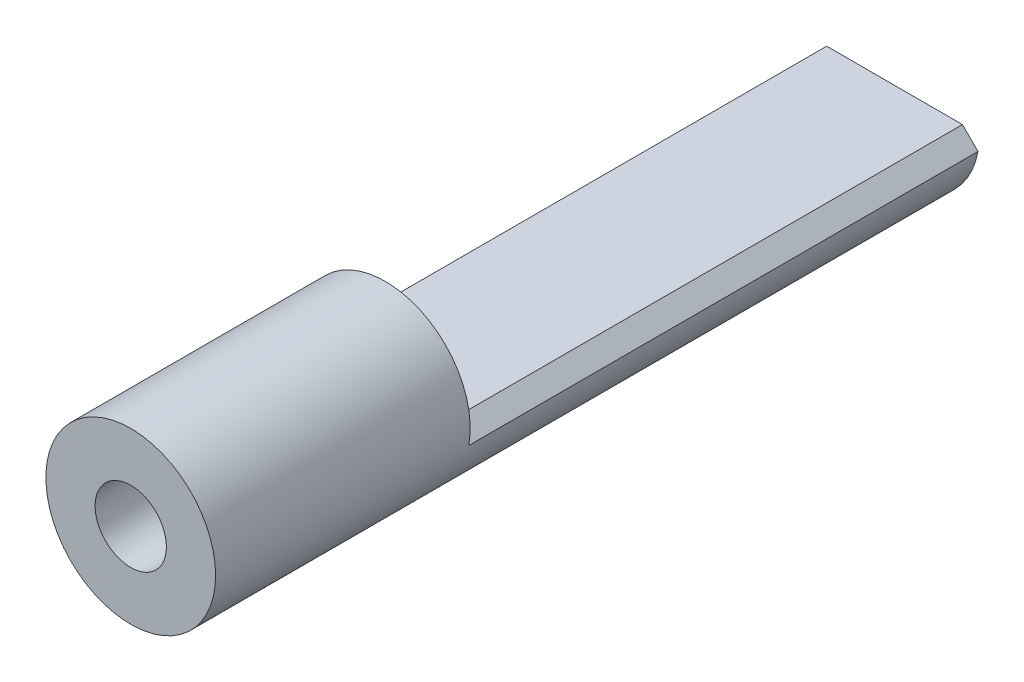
ISO-10303-21;
HEADER;
FILE_DESCRIPTION(('STEP AP214'),'2;1');
FILE_NAME('part.step','',(''),(''),'','','');
FILE_SCHEMA(('AUTOMOTIVE_DESIGN { 1 0 10303 214 1 1 1 1 }'));
ENDSEC;
DATA;
#1=APPLICATION_CONTEXT('core data for automotive mechanical design processes');
#2=APPLICATION_PROTOCOL_DEFINITION('international standard','automotive_design',2000,#1);
#3=PRODUCT_CONTEXT('',#1,'mechanical');
#4=PRODUCT('Part','Part','',(#3));
#5=PRODUCT_RELATED_PRODUCT_CATEGORY('part','',(#4));
#6=PRODUCT_DEFINITION_FORMATION('','',#4);
#7=PRODUCT_DEFINITION_CONTEXT('part definition',#1,'design');
#8=PRODUCT_DEFINITION('design','',#6,#7);
#9=PRODUCT_DEFINITION_SHAPE('','',#8);
#10=(LENGTH_UNIT() NAMED_UNIT(*) SI_UNIT(.MILLI.,.METRE.));
#11=(NAMED_UNIT(*) PLANE_ANGLE_UNIT() SI_UNIT($,.RADIAN.));
#12=(NAMED_UNIT(*) SI_UNIT($,.STERADIAN.) SOLID_ANGLE_UNIT());
#13=UNCERTAINTY_MEASURE_WITH_UNIT(LENGTH_MEASURE(1.E-05),#10,'distance_accuracy_value','');
#14=(GEOMETRIC_REPRESENTATION_CONTEXT(3) GLOBAL_UNCERTAINTY_ASSIGNED_CONTEXT((#13)) GLOBAL_UNIT_ASSIGNED_CONTEXT((#10,
#11,#12)) REPRESENTATION_CONTEXT('',''));
#15=CARTESIAN_POINT('',(0.,0.,0.));
#16=DIRECTION('',(0.,0.,1.));
#17=DIRECTION('',(1.,0.,0.));
#18=AXIS2_PLACEMENT_3D('',#15,#16,#17);
#19=CARTESIAN_POINT('',(0.,0.,45.));
#20=DIRECTION('',(0.,0.,-1.));
#21=DIRECTION('',(-1.,0.,0.));
#22=AXIS2_PLACEMENT_3D('',#19,#20,#21);
#23=CYLINDRICAL_SURFACE('',#22,5.);
#24=CARTESIAN_POINT('',(0.,0.,45.));
#25=DIRECTION('',(0.,0.,1.));
#26=DIRECTION('',(1.,0.,0.));
#27=AXIS2_PLACEMENT_3D('',#24,#25,#26);
#28=CIRCLE('',#27,5.);
#29=CARTESIAN_POINT('',(5.,0.,45.));
#30=VERTEX_POINT('',#29);
#31=EDGE_CURVE('E141',#30,#30,#28,.T.);
#32=ORIENTED_EDGE('',*,*,#31,.F.);
#33=EDGE_LOOP('',(#32));
#34=FACE_BOUND('',#33,.T.);
#35=CARTESIAN_POINT('',(0.,0.,30.));
#36=DIRECTION('',(0.,0.,1.));
#37=DIRECTION('',(1.,0.,0.));
#38=AXIS2_PLACEMENT_3D('',#35,#36,#37);
#39=CIRCLE('',#38,5.);
#40=CARTESIAN_POINT('',(-4.91547594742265,-0.91547594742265,30.));
#41=VERTEX_POINT('',#40);
#42=CARTESIAN_POINT('',(4.91547594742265,-0.915475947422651,30.));
#43=VERTEX_POINT('',#42);
#44=EDGE_CURVE('E137',#41,#43,#39,.F.);
#45=ORIENTED_EDGE('',*,*,#44,.F.);
#46=DIRECTION('',(0.,0.,-1.));
#47=VECTOR('',#46,1.);
#48=CARTESIAN_POINT('',(-4.91547594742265,-0.915475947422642,45.));
#49=LINE('',#48,#47);
#50=CARTESIAN_POINT('',(-4.91547594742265,-0.915475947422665,0.));
#51=VERTEX_POINT('',#50);
#52=EDGE_CURVE('E152',#41,#51,#49,.T.);
#53=ORIENTED_EDGE('',*,*,#52,.T.);
#54=CARTESIAN_POINT('',(0.,0.,0.));
#55=DIRECTION('',(0.,0.,1.));
#56=DIRECTION('',(1.,0.,0.));
#57=AXIS2_PLACEMENT_3D('',#54,#55,#56);
#58=CIRCLE('',#57,5.);
#59=CARTESIAN_POINT('',(4.91547594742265,-0.915475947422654,0.));
#60=VERTEX_POINT('',#59);
#61=EDGE_CURVE('E140',#51,#60,#58,.T.);
#62=ORIENTED_EDGE('',*,*,#61,.T.);
#63=DIRECTION('',(0.,0.,-1.));
#64=VECTOR('',#63,1.);
#65=CARTESIAN_POINT('',(4.91547594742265,-0.915475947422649,45.));
#66=LINE('',#65,#64);
#67=EDGE_CURVE('E145',#60,#43,#66,.F.);
#68=ORIENTED_EDGE('',*,*,#67,.T.);
#69=EDGE_LOOP('',(#45,#53,#62,#68));
#70=FACE_BOUND('',#69,.T.);
#71=ADVANCED_FACE('F49',(#34,#70),#23,.T.);
#72=CARTESIAN_POINT('',(0.,0.,45.));
#73=DIRECTION('',(0.,0.,1.));
#74=DIRECTION('',(1.,0.,0.));
#75=AXIS2_PLACEMENT_3D('',#72,#73,#74);
#76=PLANE('',#75);
#77=CARTESIAN_POINT('',(0.,0.,45.));
#78=DIRECTION('',(0.,0.,1.));
#79=DIRECTION('',(1.,0.,0.));
#80=AXIS2_PLACEMENT_3D('',#77,#78,#79);
#81=CIRCLE('',#80,2.1);
#82=CARTESIAN_POINT('',(2.1,0.,45.));
#83=VERTEX_POINT('',#82);
#84=EDGE_CURVE('E123',#83,#83,#81,.T.);
#85=ORIENTED_EDGE('',*,*,#84,.F.);
#86=EDGE_LOOP('',(#85));
#87=FACE_BOUND('',#86,.T.);
#88=ORIENTED_EDGE('',*,*,#31,.T.);
#89=EDGE_LOOP('',(#88));
#90=FACE_BOUND('',#89,.T.);
#91=ADVANCED_FACE('F195',(#87,#90),#76,.T.);
#92=CARTESIAN_POINT('',(0.,0.,0.));
#93=DIRECTION('',(0.,0.,1.));
#94=DIRECTION('',(1.,0.,0.));
#95=AXIS2_PLACEMENT_3D('',#92,#93,#94);
#96=PLANE('',#95);
#97=CARTESIAN_POINT('',(2.47487373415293,-2.4748737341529,0.));
#98=DIRECTION('',(0.,0.,-1.));
#99=DIRECTION('',(-1.,0.,0.));
#100=AXIS2_PLACEMENT_3D('',#97,#98,#99);
#101=CIRCLE('',#100,0.799999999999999);
#102=CARTESIAN_POINT('',(1.67487373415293,-2.4748737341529,0.));
#103=VERTEX_POINT('',#102);
#104=EDGE_CURVE('E110',#103,#103,#101,.T.);
#105=ORIENTED_EDGE('',*,*,#104,.F.);
#106=EDGE_LOOP('',(#105));
#107=FACE_BOUND('',#106,.T.);
#108=CARTESIAN_POINT('',(-2.4748737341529,-2.47487373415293,0.));
#109=DIRECTION('',(0.,0.,-1.));
#110=DIRECTION('',(-1.,0.,0.));
#111=AXIS2_PLACEMENT_3D('',#108,#109,#110);
#112=CIRCLE('',#111,0.799999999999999);
#113=CARTESIAN_POINT('',(-3.2748737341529,-2.47487373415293,0.));
#114=VERTEX_POINT('',#113);
#115=EDGE_CURVE('E109',#114,#114,#112,.T.);
#116=ORIENTED_EDGE('',*,*,#115,.F.);
#117=EDGE_LOOP('',(#116));
#118=FACE_BOUND('',#117,.T.);
#119=ORIENTED_EDGE('',*,*,#61,.F.);
#120=DIRECTION('',(-0.707106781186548,-0.707106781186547,0.));
#121=VECTOR('',#120,1.);
#122=CARTESIAN_POINT('',(-4.91547594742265,-0.915475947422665,0.));
#123=LINE('',#122,#121);
#124=CARTESIAN_POINT('',(-3.99999999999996,0.,0.));
#125=VERTEX_POINT('',#124);
#126=EDGE_CURVE('E159',#51,#125,#123,.F.);
#127=ORIENTED_EDGE('',*,*,#126,.T.);
#128=DIRECTION('',(-1.,0.,0.));
#129=VECTOR('',#128,1.);
#130=CARTESIAN_POINT('',(5.,0.,0.));
#131=LINE('',#130,#129);
#132=CARTESIAN_POINT('',(4.,0.,0.));
#133=VERTEX_POINT('',#132);
#134=EDGE_CURVE('E131',#133,#125,#131,.T.);
#135=ORIENTED_EDGE('',*,*,#134,.F.);
#136=DIRECTION('',(-0.707106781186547,0.707106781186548,0.));
#137=VECTOR('',#136,1.);
#138=CARTESIAN_POINT('',(4.,0.,0.));
#139=LINE('',#138,#137);
#140=EDGE_CURVE('E156',#133,#60,#139,.F.);
#141=ORIENTED_EDGE('',*,*,#140,.T.);
#142=EDGE_LOOP('',(#119,#127,#135,#141));
#143=FACE_BOUND('',#142,.T.);
#144=ADVANCED_FACE('F178',(#107,#118,#143),#96,.F.);
#145=CARTESIAN_POINT('',(0.,0.,30.));
#146=DIRECTION('',(0.,0.,1.));
#147=DIRECTION('',(1.,0.,0.));
#148=AXIS2_PLACEMENT_3D('',#145,#146,#147);
#149=PLANE('',#148);
#150=ORIENTED_EDGE('',*,*,#44,.T.);
#151=DIRECTION('',(0.707106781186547,-0.707106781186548,0.));
#152=VECTOR('',#151,1.);
#153=CARTESIAN_POINT('',(2.,2.,30.));
#154=LINE('',#153,#152);
#155=CARTESIAN_POINT('',(4.00000000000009,0.,30.));
#156=VERTEX_POINT('',#155);
#157=EDGE_CURVE('E12',#43,#156,#154,.F.);
#158=ORIENTED_EDGE('',*,*,#157,.T.);
#159=DIRECTION('',(-1.,0.,0.));
#160=VECTOR('',#159,1.);
#161=CARTESIAN_POINT('',(5.,0.,30.));
#162=LINE('',#161,#160);
#163=CARTESIAN_POINT('',(-3.99999999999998,0.,30.));
#164=VERTEX_POINT('',#163);
#165=EDGE_CURVE('E134',#156,#164,#162,.T.);
#166=ORIENTED_EDGE('',*,*,#165,.T.);
#167=DIRECTION('',(0.707106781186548,0.707106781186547,0.));
#168=VECTOR('',#167,1.);
#169=CARTESIAN_POINT('',(-1.99999999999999,1.99999999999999,30.));
#170=LINE('',#169,#168);
#171=EDGE_CURVE('E59',#164,#41,#170,.F.);
#172=ORIENTED_EDGE('',*,*,#171,.T.);
#173=EDGE_LOOP('',(#150,#158,#166,#172));
#174=FACE_BOUND('',#173,.T.);
#175=ADVANCED_FACE('F171',(#174),#149,.F.);
#176=CARTESIAN_POINT('',(5.,0.,56.1803398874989));
#177=DIRECTION('',(0.,-1.,0.));
#178=DIRECTION('',(0.,0.,-1.));
#179=AXIS2_PLACEMENT_3D('',#176,#177,#178);
#180=PLANE('',#179);
#181=ORIENTED_EDGE('',*,*,#134,.T.);
#182=DIRECTION('',(0.,0.,1.));
#183=VECTOR('',#182,1.);
#184=CARTESIAN_POINT('',(-4.,0.,56.1803398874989));
#185=LINE('',#184,#183);
#186=EDGE_CURVE('E66',#125,#164,#185,.T.);
#187=ORIENTED_EDGE('',*,*,#186,.T.);
#188=ORIENTED_EDGE('',*,*,#165,.F.);
#189=DIRECTION('',(0.,0.,-1.));
#190=VECTOR('',#189,1.);
#191=CARTESIAN_POINT('',(4.00000000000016,0.,56.1803398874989));
#192=LINE('',#191,#190);
#193=EDGE_CURVE('E162',#156,#133,#192,.T.);
#194=ORIENTED_EDGE('',*,*,#193,.T.);
#195=EDGE_LOOP('',(#181,#187,#188,#194));
#196=FACE_BOUND('',#195,.T.);
#197=ADVANCED_FACE('F182',(#196),#180,.F.);
#198=CARTESIAN_POINT('',(0.,0.,32.2618072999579));
#199=DIRECTION('',(0.,0.,1.));
#200=DIRECTION('',(1.,0.,0.));
#201=AXIS2_PLACEMENT_3D('',#198,#199,#200);
#202=CONICAL_SURFACE('',#201,2.1,1.02974425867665);
#203=CARTESIAN_POINT('',(0.,0.,31.));
#204=VERTEX_POINT('',#203);
#205=VERTEX_LOOP('',#204);
#206=FACE_BOUND('',#205,.T.);
#207=CARTESIAN_POINT('',(0.,0.,32.2618072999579));
#208=DIRECTION('',(0.,0.,1.));
#209=DIRECTION('',(1.,0.,0.));
#210=AXIS2_PLACEMENT_3D('',#207,#208,#209);
#211=CIRCLE('',#210,2.1);
#212=CARTESIAN_POINT('',(2.1,0.,32.2618072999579));
#213=VERTEX_POINT('',#212);
#214=EDGE_CURVE('E127',#213,#213,#211,.T.);
#215=ORIENTED_EDGE('',*,*,#214,.T.);
#216=EDGE_LOOP('',(#215));
#217=FACE_BOUND('',#216,.T.);
#218=ADVANCED_FACE('F184',(#206,#217),#202,.F.);
#219=CARTESIAN_POINT('',(0.,0.,45.));
#220=DIRECTION('',(0.,0.,1.));
#221=DIRECTION('',(1.,0.,0.));
#222=AXIS2_PLACEMENT_3D('',#219,#220,#221);
#223=CYLINDRICAL_SURFACE('',#222,2.1);
#224=ORIENTED_EDGE('',*,*,#214,.F.);
#225=EDGE_LOOP('',(#224));
#226=FACE_BOUND('',#225,.T.);
#227=ORIENTED_EDGE('',*,*,#84,.T.);
#228=EDGE_LOOP('',(#227));
#229=FACE_BOUND('',#228,.T.);
#230=ADVANCED_FACE('F190',(#226,#229),#223,.F.);
#231=CARTESIAN_POINT('',(-4.91547594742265,-0.915475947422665,45.));
#232=DIRECTION('',(0.707106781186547,-0.707106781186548,0.));
#233=DIRECTION('',(0.,0.,-1.));
#234=AXIS2_PLACEMENT_3D('',#231,#232,#233);
#235=PLANE('',#234);
#236=ORIENTED_EDGE('',*,*,#171,.F.);
#237=ORIENTED_EDGE('',*,*,#186,.F.);
#238=ORIENTED_EDGE('',*,*,#126,.F.);
#239=ORIENTED_EDGE('',*,*,#52,.F.);
#240=EDGE_LOOP('',(#236,#237,#238,#239));
#241=FACE_BOUND('',#240,.T.);
#242=ADVANCED_FACE('F173',(#241),#235,.F.);
#243=CARTESIAN_POINT('',(4.,0.,45.));
#244=DIRECTION('',(-0.707106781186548,-0.707106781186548,0.));
#245=DIRECTION('',(0.,0.,-1.));
#246=AXIS2_PLACEMENT_3D('',#243,#244,#245);
#247=PLANE('',#246);
#248=ORIENTED_EDGE('',*,*,#157,.F.);
#249=ORIENTED_EDGE('',*,*,#67,.F.);
#250=ORIENTED_EDGE('',*,*,#140,.F.);
#251=ORIENTED_EDGE('',*,*,#193,.F.);
#252=EDGE_LOOP('',(#248,#249,#250,#251));
#253=FACE_BOUND('',#252,.T.);
#254=ADVANCED_FACE('F52',(#253),#247,.F.);
#255=CARTESIAN_POINT('',(-2.4748737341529,-2.47487373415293,6.));
#256=DIRECTION('',(0.,0.,-1.));
#257=DIRECTION('',(-1.,0.,0.));
#258=AXIS2_PLACEMENT_3D('',#255,#256,#257);
#259=CONICAL_SURFACE('',#258,0.799999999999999,1.02974425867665);
#260=CARTESIAN_POINT('',(-2.4748737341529,-2.47487373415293,6.48068849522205));
#261=VERTEX_POINT('',#260);
#262=VERTEX_LOOP('',#261);
#263=FACE_BOUND('',#262,.T.);
#264=CARTESIAN_POINT('',(-2.4748737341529,-2.47487373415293,6.));
#265=DIRECTION('',(0.,0.,-1.));
#266=DIRECTION('',(-1.,0.,0.));
#267=AXIS2_PLACEMENT_3D('',#264,#265,#266);
#268=CIRCLE('',#267,0.799999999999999);
#269=CARTESIAN_POINT('',(-3.2748737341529,-2.47487373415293,6.));
#270=VERTEX_POINT('',#269);
#271=EDGE_CURVE('E115',#270,#270,#268,.T.);
#272=ORIENTED_EDGE('',*,*,#271,.T.);
#273=EDGE_LOOP('',(#272));
#274=FACE_BOUND('',#273,.T.);
#275=ADVANCED_FACE('F213',(#263,#274),#259,.F.);
#276=CARTESIAN_POINT('',(-2.4748737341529,-2.47487373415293,0.));
#277=DIRECTION('',(0.,0.,-1.));
#278=DIRECTION('',(-1.,0.,0.));
#279=AXIS2_PLACEMENT_3D('',#276,#277,#278);
#280=CYLINDRICAL_SURFACE('',#279,0.799999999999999);
#281=ORIENTED_EDGE('',*,*,#271,.F.);
#282=EDGE_LOOP('',(#281));
#283=FACE_BOUND('',#282,.T.);
#284=ORIENTED_EDGE('',*,*,#115,.T.);
#285=EDGE_LOOP('',(#284));
#286=FACE_BOUND('',#285,.T.);
#287=ADVANCED_FACE('F102',(#283,#286),#280,.F.);
#288=CARTESIAN_POINT('',(2.47487373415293,-2.4748737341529,6.));
#289=DIRECTION('',(0.,0.,-1.));
#290=DIRECTION('',(-1.,0.,0.));
#291=AXIS2_PLACEMENT_3D('',#288,#289,#290);
#292=CONICAL_SURFACE('',#291,0.799999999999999,1.02974425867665);
#293=CARTESIAN_POINT('',(2.47487373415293,-2.4748737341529,6.48068849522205));
#294=VERTEX_POINT('',#293);
#295=VERTEX_LOOP('',#294);
#296=FACE_BOUND('',#295,.T.);
#297=CARTESIAN_POINT('',(2.47487373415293,-2.4748737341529,6.));
#298=DIRECTION('',(0.,0.,-1.));
#299=DIRECTION('',(-1.,0.,0.));
#300=AXIS2_PLACEMENT_3D('',#297,#298,#299);
#301=CIRCLE('',#300,0.799999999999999);
#302=CARTESIAN_POINT('',(1.67487373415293,-2.4748737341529,6.));
#303=VERTEX_POINT('',#302);
#304=EDGE_CURVE('E106',#303,#303,#301,.T.);
#305=ORIENTED_EDGE('',*,*,#304,.T.);
#306=EDGE_LOOP('',(#305));
#307=FACE_BOUND('',#306,.T.);
#308=ADVANCED_FACE('F98',(#296,#307),#292,.F.);
#309=CARTESIAN_POINT('',(2.47487373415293,-2.4748737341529,0.));
#310=DIRECTION('',(0.,0.,-1.));
#311=DIRECTION('',(-1.,0.,0.));
#312=AXIS2_PLACEMENT_3D('',#309,#310,#311);
#313=CYLINDRICAL_SURFACE('',#312,0.799999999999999);
#314=ORIENTED_EDGE('',*,*,#304,.F.);
#315=EDGE_LOOP('',(#314));
#316=FACE_BOUND('',#315,.T.);
#317=ORIENTED_EDGE('',*,*,#104,.T.);
#318=EDGE_LOOP('',(#317));
#319=FACE_BOUND('',#318,.T.);
#320=ADVANCED_FACE('F101',(#316,#319),#313,.F.);
#321=CLOSED_SHELL('',(#71,#91,#144,#175,#197,#218,#230,#242,#254,#275,#287,#308,#320));
#322=MANIFOLD_SOLID_BREP('B2',#321);
#323=ADVANCED_BREP_SHAPE_REPRESENTATION('',(#18,#322),#14);
#324=SHAPE_DEFINITION_REPRESENTATION(#9,#323);
ENDSEC;
END-ISO-10303-21;
